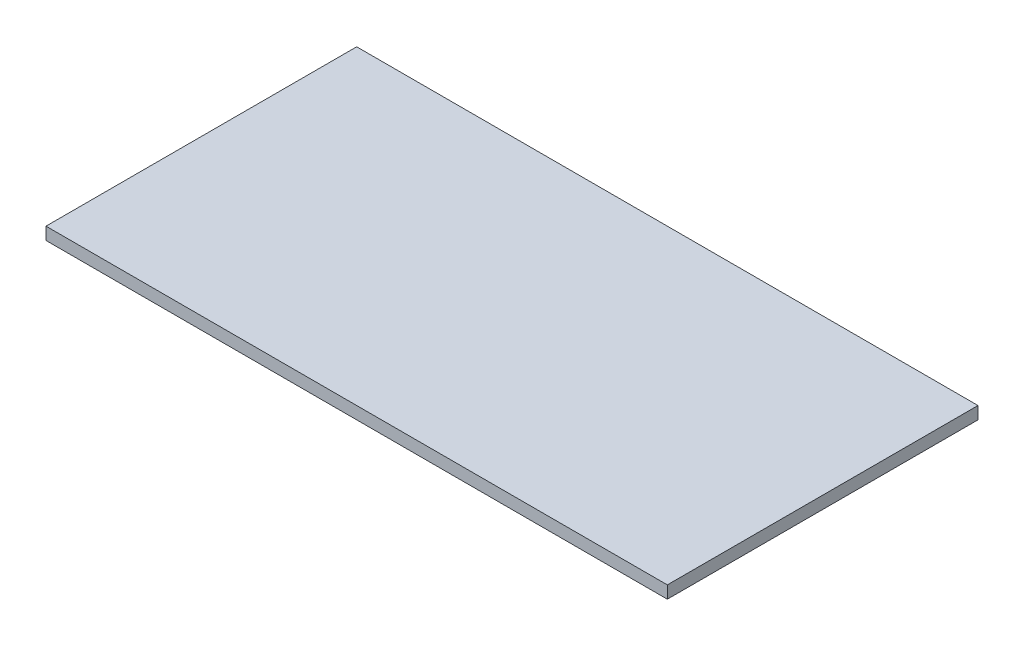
from build123d import *

# Parameters (mm, degrees)
SKIZZE1_W               = 500
SKIZZE1_H               = 250
LINEAR_AUSTRAGEN1_DEPTH = 5


with BuildPart() as part:
    # Skizze1 → Linear austragen1 (new, symmetric)
    with BuildSketch(Plane(origin=(0, 0, 0), x_dir=(1, 0, 0), z_dir=(0, 1, 0))):
        Rectangle(SKIZZE1_W, SKIZZE1_H)
    extrude(amount=LINEAR_AUSTRAGEN1_DEPTH, both=True)


solid = part.part
